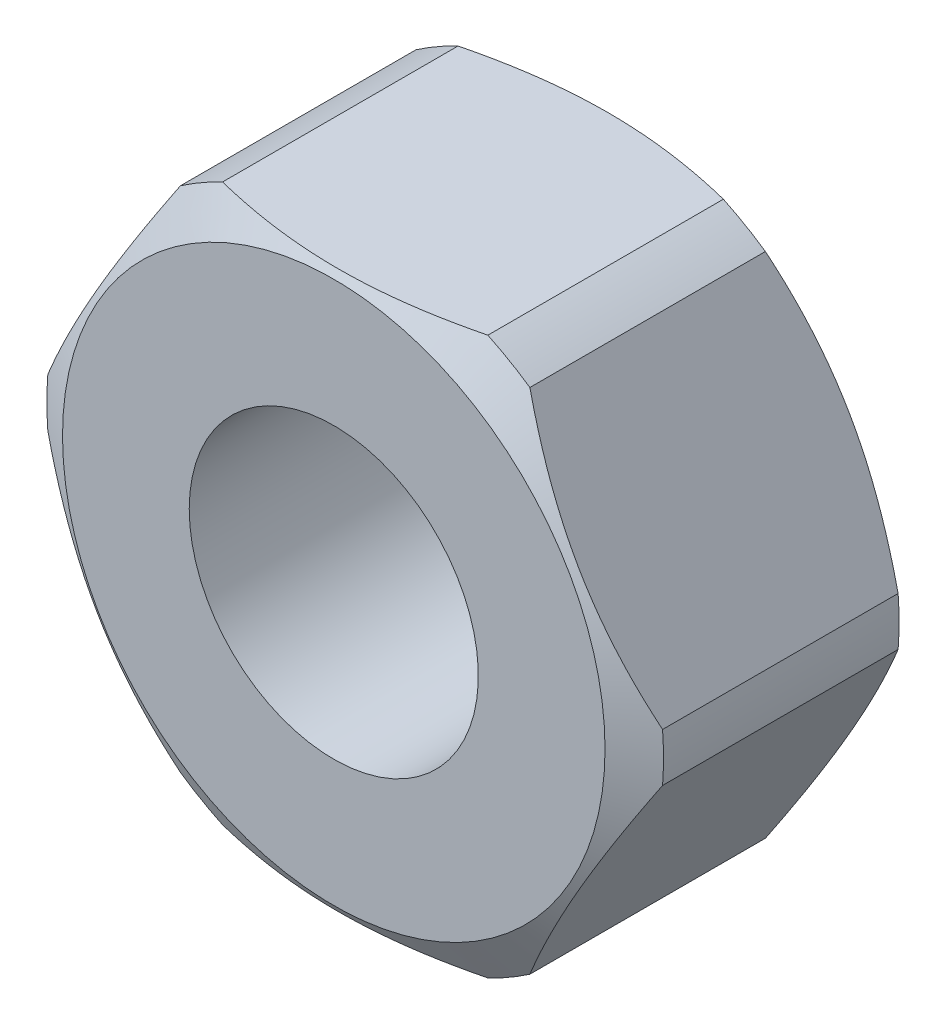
ISO-10303-21;
HEADER;
FILE_DESCRIPTION(('STEP AP214'),'2;1');
FILE_NAME('part.step','',(''),(''),'','','');
FILE_SCHEMA(('AUTOMOTIVE_DESIGN { 1 0 10303 214 1 1 1 1 }'));
ENDSEC;
DATA;
#1=APPLICATION_CONTEXT('core data for automotive mechanical design processes');
#2=APPLICATION_PROTOCOL_DEFINITION('international standard','automotive_design',2000,#1);
#3=PRODUCT_CONTEXT('',#1,'mechanical');
#4=PRODUCT('Part','Part','',(#3));
#5=PRODUCT_RELATED_PRODUCT_CATEGORY('part','',(#4));
#6=PRODUCT_DEFINITION_FORMATION('','',#4);
#7=PRODUCT_DEFINITION_CONTEXT('part definition',#1,'design');
#8=PRODUCT_DEFINITION('design','',#6,#7);
#9=PRODUCT_DEFINITION_SHAPE('','',#8);
#10=(LENGTH_UNIT() NAMED_UNIT(*) SI_UNIT(.MILLI.,.METRE.));
#11=(NAMED_UNIT(*) PLANE_ANGLE_UNIT() SI_UNIT($,.RADIAN.));
#12=(NAMED_UNIT(*) SI_UNIT($,.STERADIAN.) SOLID_ANGLE_UNIT());
#13=UNCERTAINTY_MEASURE_WITH_UNIT(LENGTH_MEASURE(1.E-05),#10,'distance_accuracy_value','');
#14=(GEOMETRIC_REPRESENTATION_CONTEXT(3) GLOBAL_UNCERTAINTY_ASSIGNED_CONTEXT((#13)) GLOBAL_UNIT_ASSIGNED_CONTEXT((#10,
#11,#12)) REPRESENTATION_CONTEXT('',''));
#15=CARTESIAN_POINT('',(0.,0.,0.));
#16=DIRECTION('',(0.,0.,1.));
#17=DIRECTION('',(1.,0.,0.));
#18=AXIS2_PLACEMENT_3D('',#15,#16,#17);
#19=CARTESIAN_POINT('',(0.,0.,6.5));
#20=DIRECTION('',(0.,0.,-1.));
#21=DIRECTION('',(-1.,0.,0.));
#22=AXIS2_PLACEMENT_3D('',#19,#20,#21);
#23=CYLINDRICAL_SURFACE('',#22,7.20062436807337);
#24=CARTESIAN_POINT('',(0.,0.,5.99999999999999));
#25=DIRECTION('',(0.,0.,1.));
#26=DIRECTION('',(1.,0.,0.));
#27=AXIS2_PLACEMENT_3D('',#24,#25,#26);
#28=CIRCLE('',#27,7.20062436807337);
#29=CARTESIAN_POINT('',(-7.17836265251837,-0.565774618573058,5.99999999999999));
#30=VERTEX_POINT('',#29);
#31=CARTESIAN_POINT('',(-7.17830561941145,0.566497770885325,5.99999999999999));
#32=VERTEX_POINT('',#31);
#33=EDGE_CURVE('E143',#30,#32,#28,.F.);
#34=ORIENTED_EDGE('',*,*,#33,.T.);
#35=DIRECTION('',(0.,0.,-1.));
#36=VECTOR('',#35,1.);
#37=CARTESIAN_POINT('',(-7.17830561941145,0.566497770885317,6.5));
#38=LINE('',#37,#36);
#39=CARTESIAN_POINT('',(-7.17830561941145,0.566497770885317,0.500000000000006));
#40=VERTEX_POINT('',#39);
#41=EDGE_CURVE('E51',#32,#40,#38,.T.);
#42=ORIENTED_EDGE('',*,*,#41,.T.);
#43=CARTESIAN_POINT('',(0.,0.,0.500000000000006));
#44=DIRECTION('',(0.,0.,1.));
#45=DIRECTION('',(1.,0.,0.));
#46=AXIS2_PLACEMENT_3D('',#43,#44,#45);
#47=CIRCLE('',#46,7.20062436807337);
#48=CARTESIAN_POINT('',(-7.17836265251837,-0.565774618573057,0.500000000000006));
#49=VERTEX_POINT('',#48);
#50=EDGE_CURVE('E291',#40,#49,#47,.T.);
#51=ORIENTED_EDGE('',*,*,#50,.T.);
#52=DIRECTION('',(0.,0.,-1.));
#53=VECTOR('',#52,1.);
#54=CARTESIAN_POINT('',(-7.17836265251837,-0.565774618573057,6.5));
#55=LINE('',#54,#53);
#56=EDGE_CURVE('E290',#49,#30,#55,.F.);
#57=ORIENTED_EDGE('',*,*,#56,.T.);
#58=EDGE_LOOP('',(#34,#42,#51,#57));
#59=FACE_BOUND('',#58,.T.);
#60=ADVANCED_FACE('F32',(#59),#23,.T.);
#61=CARTESIAN_POINT('',(-3.09953346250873,-6.49937563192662,6.00000000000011));
#62=VERTEX_POINT('',#61);
#63=CARTESIAN_POINT('',(-4.0791565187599,-5.93375710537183,5.99999999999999));
#64=VERTEX_POINT('',#63);
#65=EDGE_CURVE('E147',#62,#64,#28,.F.);
#66=ORIENTED_EDGE('',*,*,#65,.T.);
#67=DIRECTION('',(0.,0.,-1.));
#68=VECTOR('',#67,1.);
#69=CARTESIAN_POINT('',(-4.0791565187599,-5.93375710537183,6.5));
#70=LINE('',#69,#68);
#71=CARTESIAN_POINT('',(-4.0791565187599,-5.93375710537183,0.500000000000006));
#72=VERTEX_POINT('',#71);
#73=EDGE_CURVE('E59',#64,#72,#70,.T.);
#74=ORIENTED_EDGE('',*,*,#73,.T.);
#75=CARTESIAN_POINT('',(-3.09953346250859,-6.49937563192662,0.500000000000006));
#76=VERTEX_POINT('',#75);
#77=EDGE_CURVE('E299',#72,#76,#47,.T.);
#78=ORIENTED_EDGE('',*,*,#77,.T.);
#79=DIRECTION('',(0.,0.,-1.));
#80=VECTOR('',#79,1.);
#81=CARTESIAN_POINT('',(-3.09953346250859,-6.49937563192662,6.5));
#82=LINE('',#81,#80);
#83=EDGE_CURVE('E177',#76,#62,#82,.F.);
#84=ORIENTED_EDGE('',*,*,#83,.T.);
#85=EDGE_LOOP('',(#66,#74,#78,#84));
#86=FACE_BOUND('',#85,.T.);
#87=ADVANCED_FACE('F174',(#86),#23,.T.);
#88=CARTESIAN_POINT('',(4.07915651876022,-5.93375710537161,5.99999999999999));
#89=VERTEX_POINT('',#88);
#90=CARTESIAN_POINT('',(3.09953346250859,-6.49937563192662,5.99999999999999));
#91=VERTEX_POINT('',#90);
#92=EDGE_CURVE('E160',#89,#91,#28,.F.);
#93=ORIENTED_EDGE('',*,*,#92,.T.);
#94=DIRECTION('',(0.,0.,-1.));
#95=VECTOR('',#94,1.);
#96=CARTESIAN_POINT('',(3.09953346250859,-6.49937563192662,6.5));
#97=LINE('',#96,#95);
#98=CARTESIAN_POINT('',(3.09953346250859,-6.49937563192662,0.500000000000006));
#99=VERTEX_POINT('',#98);
#100=EDGE_CURVE('E255',#91,#99,#97,.T.);
#101=ORIENTED_EDGE('',*,*,#100,.T.);
#102=CARTESIAN_POINT('',(4.07915651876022,-5.93375710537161,0.500000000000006));
#103=VERTEX_POINT('',#102);
#104=EDGE_CURVE('E301',#99,#103,#47,.T.);
#105=ORIENTED_EDGE('',*,*,#104,.T.);
#106=DIRECTION('',(0.,0.,-1.));
#107=VECTOR('',#106,1.);
#108=CARTESIAN_POINT('',(4.07915651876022,-5.93375710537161,6.5));
#109=LINE('',#108,#107);
#110=EDGE_CURVE('E254',#103,#89,#109,.F.);
#111=ORIENTED_EDGE('',*,*,#110,.T.);
#112=EDGE_LOOP('',(#93,#101,#105,#111));
#113=FACE_BOUND('',#112,.T.);
#114=ADVANCED_FACE('F288',(#113),#23,.T.);
#115=CARTESIAN_POINT('',(7.17830561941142,0.566497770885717,5.99999999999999));
#116=VERTEX_POINT('',#115);
#117=CARTESIAN_POINT('',(7.17836265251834,-0.565774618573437,5.99999999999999));
#118=VERTEX_POINT('',#117);
#119=EDGE_CURVE('E154',#116,#118,#28,.F.);
#120=ORIENTED_EDGE('',*,*,#119,.T.);
#121=DIRECTION('',(0.,0.,-1.));
#122=VECTOR('',#121,1.);
#123=CARTESIAN_POINT('',(7.17836265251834,-0.565774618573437,6.5));
#124=LINE('',#123,#122);
#125=CARTESIAN_POINT('',(7.17836265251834,-0.565774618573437,0.500000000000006));
#126=VERTEX_POINT('',#125);
#127=EDGE_CURVE('E256',#118,#126,#124,.T.);
#128=ORIENTED_EDGE('',*,*,#127,.T.);
#129=CARTESIAN_POINT('',(7.17830561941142,0.566497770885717,0.500000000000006));
#130=VERTEX_POINT('',#129);
#131=EDGE_CURVE('E158',#126,#130,#47,.T.);
#132=ORIENTED_EDGE('',*,*,#131,.T.);
#133=DIRECTION('',(0.,0.,-1.));
#134=VECTOR('',#133,1.);
#135=CARTESIAN_POINT('',(7.17830561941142,0.566497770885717,6.5));
#136=LINE('',#135,#134);
#137=EDGE_CURVE('E258',#130,#116,#136,.F.);
#138=ORIENTED_EDGE('',*,*,#137,.T.);
#139=EDGE_LOOP('',(#120,#128,#132,#138));
#140=FACE_BOUND('',#139,.T.);
#141=ADVANCED_FACE('F335',(#140),#23,.T.);
#142=CARTESIAN_POINT('',(3.09822389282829,6.5,5.99999999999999));
#143=VERTEX_POINT('',#142);
#144=CARTESIAN_POINT('',(4.07975427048,5.93334613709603,5.99999999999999));
#145=VERTEX_POINT('',#144);
#146=EDGE_CURVE('E146',#143,#145,#28,.F.);
#147=ORIENTED_EDGE('',*,*,#146,.T.);
#148=DIRECTION('',(0.,0.,-1.));
#149=VECTOR('',#148,1.);
#150=CARTESIAN_POINT('',(4.07975427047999,5.93334613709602,6.5));
#151=LINE('',#150,#149);
#152=CARTESIAN_POINT('',(4.07975427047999,5.93334613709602,0.500000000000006));
#153=VERTEX_POINT('',#152);
#154=EDGE_CURVE('E262',#145,#153,#151,.T.);
#155=ORIENTED_EDGE('',*,*,#154,.T.);
#156=CARTESIAN_POINT('',(3.09822389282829,6.5,0.500000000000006));
#157=VERTEX_POINT('',#156);
#158=EDGE_CURVE('E153',#153,#157,#47,.T.);
#159=ORIENTED_EDGE('',*,*,#158,.T.);
#160=DIRECTION('',(0.,0.,-1.));
#161=VECTOR('',#160,1.);
#162=CARTESIAN_POINT('',(3.09822389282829,6.5,6.5));
#163=LINE('',#162,#161);
#164=EDGE_CURVE('E265',#157,#143,#163,.F.);
#165=ORIENTED_EDGE('',*,*,#164,.T.);
#166=EDGE_LOOP('',(#147,#155,#159,#165));
#167=FACE_BOUND('',#166,.T.);
#168=ADVANCED_FACE('F282',(#167),#23,.T.);
#169=CARTESIAN_POINT('',(0.,0.,6.5));
#170=DIRECTION('',(0.,0.,1.));
#171=DIRECTION('',(1.,0.,0.));
#172=AXIS2_PLACEMENT_3D('',#169,#170,#171);
#173=PLANE('',#172);
#174=CARTESIAN_POINT('',(0.,0.,6.5));
#175=DIRECTION('',(0.,0.,1.));
#176=DIRECTION('',(1.,0.,0.));
#177=AXIS2_PLACEMENT_3D('',#174,#175,#176);
#178=CIRCLE('',#177,6.33459896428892);
#179=CARTESIAN_POINT('',(6.33459896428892,0.,6.5));
#180=VERTEX_POINT('',#179);
#181=EDGE_CURVE('E305',#180,#180,#178,.T.);
#182=ORIENTED_EDGE('',*,*,#181,.T.);
#183=EDGE_LOOP('',(#182));
#184=FACE_BOUND('',#183,.T.);
#185=CARTESIAN_POINT('',(0.,0.,6.5));
#186=DIRECTION('',(0.,0.,1.));
#187=DIRECTION('',(1.,0.,0.));
#188=AXIS2_PLACEMENT_3D('',#185,#186,#187);
#189=CIRCLE('',#188,3.3756527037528);
#190=CARTESIAN_POINT('',(-3.3756527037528,0.,6.5));
#191=VERTEX_POINT('',#190);
#192=EDGE_CURVE('E144',#191,#191,#189,.T.);
#193=ORIENTED_EDGE('',*,*,#192,.F.);
#194=EDGE_LOOP('',(#193));
#195=FACE_BOUND('',#194,.T.);
#196=ADVANCED_FACE('F334',(#184,#195),#173,.T.);
#197=CARTESIAN_POINT('',(0.,0.,0.));
#198=DIRECTION('',(0.,0.,1.));
#199=DIRECTION('',(1.,0.,0.));
#200=AXIS2_PLACEMENT_3D('',#197,#198,#199);
#201=PLANE('',#200);
#202=CARTESIAN_POINT('',(0.,0.,0.));
#203=DIRECTION('',(0.,0.,1.));
#204=DIRECTION('',(1.,0.,0.));
#205=AXIS2_PLACEMENT_3D('',#202,#203,#204);
#206=CIRCLE('',#205,6.33459896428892);
#207=CARTESIAN_POINT('',(6.33459896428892,0.,0.));
#208=VERTEX_POINT('',#207);
#209=EDGE_CURVE('E300',#208,#208,#206,.F.);
#210=ORIENTED_EDGE('',*,*,#209,.T.);
#211=EDGE_LOOP('',(#210));
#212=FACE_BOUND('',#211,.T.);
#213=CARTESIAN_POINT('',(0.,0.,0.));
#214=DIRECTION('',(0.,0.,1.));
#215=DIRECTION('',(1.,0.,0.));
#216=AXIS2_PLACEMENT_3D('',#213,#214,#215);
#217=CIRCLE('',#216,3.3756527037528);
#218=CARTESIAN_POINT('',(-3.3756527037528,0.,0.));
#219=VERTEX_POINT('',#218);
#220=EDGE_CURVE('E149',#219,#219,#217,.T.);
#221=ORIENTED_EDGE('',*,*,#220,.T.);
#222=EDGE_LOOP('',(#221));
#223=FACE_BOUND('',#222,.T.);
#224=ADVANCED_FACE('F275',(#212,#223),#201,.F.);
#225=CARTESIAN_POINT('',(-3.09822389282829,6.5,0.500000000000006));
#226=VERTEX_POINT('',#225);
#227=CARTESIAN_POINT('',(-4.07975427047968,5.93334613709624,0.500000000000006));
#228=VERTEX_POINT('',#227);
#229=EDGE_CURVE('E136',#226,#228,#47,.T.);
#230=ORIENTED_EDGE('',*,*,#229,.T.);
#231=DIRECTION('',(0.,0.,-1.));
#232=VECTOR('',#231,1.);
#233=CARTESIAN_POINT('',(-4.07975427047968,5.93334613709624,6.5));
#234=LINE('',#233,#232);
#235=CARTESIAN_POINT('',(-4.07975427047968,5.93334613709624,5.99999999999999));
#236=VERTEX_POINT('',#235);
#237=EDGE_CURVE('E124',#228,#236,#234,.F.);
#238=ORIENTED_EDGE('',*,*,#237,.T.);
#239=CARTESIAN_POINT('',(-3.09822389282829,6.5,5.99999999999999));
#240=VERTEX_POINT('',#239);
#241=EDGE_CURVE('E133',#236,#240,#28,.F.);
#242=ORIENTED_EDGE('',*,*,#241,.T.);
#243=DIRECTION('',(0.,0.,-1.));
#244=VECTOR('',#243,1.);
#245=CARTESIAN_POINT('',(-3.09822389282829,6.5,6.5));
#246=LINE('',#245,#244);
#247=EDGE_CURVE('E268',#240,#226,#246,.T.);
#248=ORIENTED_EDGE('',*,*,#247,.T.);
#249=EDGE_LOOP('',(#230,#238,#242,#248));
#250=FACE_BOUND('',#249,.T.);
#251=ADVANCED_FACE('F34',(#250),#23,.T.);
#252=CARTESIAN_POINT('',(0.,0.,6.5));
#253=DIRECTION('',(0.,0.,-1.));
#254=DIRECTION('',(-1.,0.,0.));
#255=AXIS2_PLACEMENT_3D('',#252,#253,#254);
#256=CYLINDRICAL_SURFACE('',#255,3.3756527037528);
#257=CARTESIAN_POINT('',(-3.3756527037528,0.,6.5));
#258=CARTESIAN_POINT('',(-3.3756527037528,0.,6.43229166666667));
#259=CARTESIAN_POINT('',(-3.3756527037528,0.,6.36458333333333));
#260=CARTESIAN_POINT('',(-3.3756527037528,0.,6.22916666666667));
#261=CARTESIAN_POINT('',(-3.3756527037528,0.,6.16145833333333));
#262=CARTESIAN_POINT('',(-3.3756527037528,0.,6.02604166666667));
#263=CARTESIAN_POINT('',(-3.3756527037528,0.,5.95833333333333));
#264=CARTESIAN_POINT('',(-3.3756527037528,0.,5.82291666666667));
#265=CARTESIAN_POINT('',(-3.3756527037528,0.,5.75520833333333));
#266=CARTESIAN_POINT('',(-3.3756527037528,0.,5.61979166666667));
#267=CARTESIAN_POINT('',(-3.3756527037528,0.,5.55208333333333));
#268=CARTESIAN_POINT('',(-3.3756527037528,0.,5.41666666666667));
#269=CARTESIAN_POINT('',(-3.3756527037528,0.,5.34895833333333));
#270=CARTESIAN_POINT('',(-3.3756527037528,0.,5.21354166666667));
#271=CARTESIAN_POINT('',(-3.3756527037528,0.,5.14583333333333));
#272=CARTESIAN_POINT('',(-3.3756527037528,0.,5.01041666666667));
#273=CARTESIAN_POINT('',(-3.3756527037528,0.,4.94270833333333));
#274=CARTESIAN_POINT('',(-3.3756527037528,0.,4.80729166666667));
#275=CARTESIAN_POINT('',(-3.3756527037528,0.,4.73958333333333));
#276=CARTESIAN_POINT('',(-3.3756527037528,0.,4.60416666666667));
#277=CARTESIAN_POINT('',(-3.3756527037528,0.,4.53645833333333));
#278=CARTESIAN_POINT('',(-3.3756527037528,0.,4.40104166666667));
#279=CARTESIAN_POINT('',(-3.3756527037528,0.,4.33333333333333));
#280=CARTESIAN_POINT('',(-3.3756527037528,0.,4.19791666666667));
#281=CARTESIAN_POINT('',(-3.3756527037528,0.,4.13020833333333));
#282=CARTESIAN_POINT('',(-3.3756527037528,0.,3.99479166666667));
#283=CARTESIAN_POINT('',(-3.3756527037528,0.,3.92708333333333));
#284=CARTESIAN_POINT('',(-3.3756527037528,0.,3.79166666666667));
#285=CARTESIAN_POINT('',(-3.3756527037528,0.,3.72395833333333));
#286=CARTESIAN_POINT('',(-3.3756527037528,0.,3.58854166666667));
#287=CARTESIAN_POINT('',(-3.3756527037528,0.,3.52083333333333));
#288=CARTESIAN_POINT('',(-3.3756527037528,0.,3.38541666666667));
#289=CARTESIAN_POINT('',(-3.3756527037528,0.,3.31770833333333));
#290=CARTESIAN_POINT('',(-3.3756527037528,0.,3.18229166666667));
#291=CARTESIAN_POINT('',(-3.3756527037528,0.,3.11458333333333));
#292=CARTESIAN_POINT('',(-3.3756527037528,0.,2.97916666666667));
#293=CARTESIAN_POINT('',(-3.3756527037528,0.,2.91145833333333));
#294=CARTESIAN_POINT('',(-3.3756527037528,0.,2.77604166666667));
#295=CARTESIAN_POINT('',(-3.3756527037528,0.,2.70833333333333));
#296=CARTESIAN_POINT('',(-3.3756527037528,0.,2.57291666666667));
#297=CARTESIAN_POINT('',(-3.3756527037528,0.,2.50520833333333));
#298=CARTESIAN_POINT('',(-3.3756527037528,0.,2.36979166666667));
#299=CARTESIAN_POINT('',(-3.3756527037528,0.,2.30208333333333));
#300=CARTESIAN_POINT('',(-3.3756527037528,0.,2.16666666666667));
#301=CARTESIAN_POINT('',(-3.3756527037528,0.,2.09895833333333));
#302=CARTESIAN_POINT('',(-3.3756527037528,0.,1.96354166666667));
#303=CARTESIAN_POINT('',(-3.3756527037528,0.,1.89583333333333));
#304=CARTESIAN_POINT('',(-3.3756527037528,0.,1.76041666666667));
#305=CARTESIAN_POINT('',(-3.3756527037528,0.,1.69270833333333));
#306=CARTESIAN_POINT('',(-3.3756527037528,0.,1.55729166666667));
#307=CARTESIAN_POINT('',(-3.3756527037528,0.,1.48958333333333));
#308=CARTESIAN_POINT('',(-3.3756527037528,0.,1.35416666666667));
#309=CARTESIAN_POINT('',(-3.3756527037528,0.,1.28645833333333));
#310=CARTESIAN_POINT('',(-3.3756527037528,0.,1.15104166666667));
#311=CARTESIAN_POINT('',(-3.3756527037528,0.,1.08333333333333));
#312=CARTESIAN_POINT('',(-3.3756527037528,0.,0.947916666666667));
#313=CARTESIAN_POINT('',(-3.3756527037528,0.,0.880208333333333));
#314=CARTESIAN_POINT('',(-3.3756527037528,0.,0.744791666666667));
#315=CARTESIAN_POINT('',(-3.3756527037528,0.,0.677083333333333));
#316=CARTESIAN_POINT('',(-3.3756527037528,0.,0.541666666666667));
#317=CARTESIAN_POINT('',(-3.3756527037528,0.,0.473958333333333));
#318=CARTESIAN_POINT('',(-3.3756527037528,0.,0.338541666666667));
#319=CARTESIAN_POINT('',(-3.3756527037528,0.,0.270833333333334));
#320=CARTESIAN_POINT('',(-3.3756527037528,0.,0.135416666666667));
#321=CARTESIAN_POINT('',(-3.3756527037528,0.,0.0677083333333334));
#322=CARTESIAN_POINT('',(-3.3756527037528,0.,0.));
#323=B_SPLINE_CURVE_WITH_KNOTS('',3,(#257,#258,#259,#260,#261,#262,#263,#264,#265,#266,#267,
#268,#269,#270,#271,#272,#273,#274,#275,#276,#277,#278,#279,#280,#281,#282,#283,#284,#285,#286,
#287,#288,#289,#290,#291,#292,#293,#294,#295,#296,#297,#298,#299,#300,#301,#302,#303,#304,#305,
#306,#307,#308,#309,#310,#311,#312,#313,#314,#315,#316,#317,#318,#319,#320,#321,#322),
.UNSPECIFIED.,.F.,.F.,(4,2,2,2,2,2,2,2,2,2,2,2,2,2,2,2,2,2,2,2,2,2,2,2,2,2,2,2,2,2,2,2,4),(0.,
0.203125,0.40625,0.609375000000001,0.812500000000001,1.015625,1.21875,1.421875,1.625,1.828125,
2.03125,2.234375,2.4375,2.640625,2.84375,3.046875,3.25,3.453125,3.65625,3.859375,4.0625,
4.265625,4.46875,4.671875,4.875,5.078125,5.28125,5.484375,5.6875,5.890625,6.09375,6.296875,6.5),.UNSPECIFIED.);
#324=EDGE_CURVE('BSEAM217',#191,#219,#323,.T.);
#325=ORIENTED_EDGE('',*,*,#192,.T.);
#326=ORIENTED_EDGE('',*,*,#220,.F.);
#327=ORIENTED_EDGE('',*,*,#324,.T.);
#328=ORIENTED_EDGE('',*,*,#324,.F.);
#329=EDGE_LOOP('',(#325,#327,#326,#328));
#330=FACE_BOUND('',#329,.T.);
#331=ADVANCED_FACE('F217',(#330),#256,.F.);
#332=CARTESIAN_POINT('',(0.,0.,0.500000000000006));
#333=DIRECTION('',(0.,0.,1.));
#334=DIRECTION('',(1.,0.,0.));
#335=AXIS2_PLACEMENT_3D('',#332,#333,#334);
#336=CONICAL_SURFACE('',#335,7.20062436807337,1.0471975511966);
#337=CARTESIAN_POINT('',(-4.07935180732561,5.93404322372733,0.500200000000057));
#338=CARTESIAN_POINT('',(-4.15928234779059,5.7955994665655,0.460472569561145));
#339=CARTESIAN_POINT('',(-4.23951550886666,5.65663155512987,0.423103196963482));
#340=CARTESIAN_POINT('',(-4.40057318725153,5.37767147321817,0.353623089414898));
#341=CARTESIAN_POINT('',(-4.48139787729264,5.23767900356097,0.321513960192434));
#342=CARTESIAN_POINT('',(-4.64368270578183,4.9565934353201,0.263083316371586));
#343=CARTESIAN_POINT('',(-4.72514354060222,4.81549913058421,0.236769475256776));
#344=CARTESIAN_POINT('',(-4.88851000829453,4.53254010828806,0.190503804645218));
#345=CARTESIAN_POINT('',(-4.97041559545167,4.39067546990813,0.170551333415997));
#346=CARTESIAN_POINT('',(-5.13290422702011,4.10923690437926,0.137778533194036));
#347=CARTESIAN_POINT('',(-5.21348033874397,3.96967498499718,0.124821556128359));
#348=CARTESIAN_POINT('',(-5.37483384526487,3.69020251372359,0.105725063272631));
#349=CARTESIAN_POINT('',(-5.45561123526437,3.55029197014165,0.09958538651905));
#350=CARTESIAN_POINT('',(-5.61715999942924,3.27048130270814,0.0942719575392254));
#351=CARTESIAN_POINT('',(-5.69793132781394,3.130581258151,0.0950926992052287));
#352=CARTESIAN_POINT('',(-5.8593751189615,2.8509524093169,0.103665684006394));
#353=CARTESIAN_POINT('',(-5.94004758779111,2.711223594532,0.111417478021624));
#354=CARTESIAN_POINT('',(-6.11766613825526,2.40357924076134,0.135953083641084));
#355=CARTESIAN_POINT('',(-6.21455997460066,2.23575419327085,0.154262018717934));
#356=CARTESIAN_POINT('',(-6.40781261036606,1.90103080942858,0.2000991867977));
#357=CARTESIAN_POINT('',(-6.50417130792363,1.73413264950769,0.227629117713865));
#358=CARTESIAN_POINT('',(-6.69740145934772,1.39944820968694,0.291512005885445));
#359=CARTESIAN_POINT('',(-6.79426393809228,1.23167747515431,0.327972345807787));
#360=CARTESIAN_POINT('',(-6.98713320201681,0.897618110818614,0.408566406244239));
#361=CARTESIAN_POINT('',(-7.08314044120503,0.731328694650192,0.452695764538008));
#362=CARTESIAN_POINT('',(-7.17870808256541,0.565800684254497,0.500200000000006));
#363=B_SPLINE_CURVE_WITH_KNOTS('',3,(#337,#338,#339,#340,#341,#342,#343,#344,#345,#346,#347,
#348,#349,#350,#351,#352,#353,#354,#355,#356,#357,#358,#359,#360,#361,#362),.UNSPECIFIED.,.F.,
.F.,(4,2,2,2,2,2,2,2,2,2,2,2,4),(0.,0.494180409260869,0.988511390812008,1.48349302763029,
1.9784247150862,2.46330241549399,2.94816866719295,3.43265139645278,3.91710273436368,
4.5008110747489,5.08462695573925,5.67584080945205,6.26671946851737),.UNSPECIFIED.);
#364=EDGE_CURVE('E293',#228,#40,#363,.T.);
#365=ORIENTED_EDGE('',*,*,#364,.F.);
#366=ORIENTED_EDGE('',*,*,#229,.F.);
#367=CARTESIAN_POINT('',(-9.29123509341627,6.5,2.88939739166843));
#368=CARTESIAN_POINT('',(-9.01831173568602,6.5,2.76032407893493));
#369=CARTESIAN_POINT('',(-8.74468441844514,6.5,2.63270965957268));
#370=CARTESIAN_POINT('',(-8.19565467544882,6.5,2.3812167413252));
#371=CARTESIAN_POINT('',(-7.92025190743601,6.5,2.25733899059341));
#372=CARTESIAN_POINT('',(-7.36572617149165,6.5,2.01344792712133));
#373=CARTESIAN_POINT('',(-7.08659075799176,6.5,1.89346279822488));
#374=CARTESIAN_POINT('',(-6.52588428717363,6.5,1.65934673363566));
#375=CARTESIAN_POINT('',(-6.24431336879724,6.5,1.54521546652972));
#376=CARTESIAN_POINT('',(-5.67697947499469,6.5,1.32382125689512));
#377=CARTESIAN_POINT('',(-5.39120320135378,6.5,1.21659218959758));
#378=CARTESIAN_POINT('',(-4.81622306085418,6.5,1.01158106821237));
#379=CARTESIAN_POINT('',(-4.5270188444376,6.5,0.913799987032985));
#380=CARTESIAN_POINT('',(-3.94544521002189,6.5,0.730478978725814));
#381=CARTESIAN_POINT('',(-3.6530846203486,6.5,0.644911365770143));
#382=CARTESIAN_POINT('',(-3.0644092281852,6.5,0.48889097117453));
#383=CARTESIAN_POINT('',(-2.76809567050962,6.5,0.418433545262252));
#384=CARTESIAN_POINT('',(-2.16006092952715,6.5,0.293761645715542));
#385=CARTESIAN_POINT('',(-1.84818555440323,6.5,0.24027634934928));
#386=CARTESIAN_POINT('',(-1.37801604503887,6.5,0.177887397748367));
#387=CARTESIAN_POINT('',(-1.22087891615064,6.5,0.160063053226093));
#388=CARTESIAN_POINT('',(-0.906022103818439,6.5,0.130714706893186));
#389=CARTESIAN_POINT('',(-0.748302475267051,6.5,0.119190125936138));
#390=CARTESIAN_POINT('',(-0.433193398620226,6.5,0.102732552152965));
#391=CARTESIAN_POINT('',(-0.275805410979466,6.5,0.0977716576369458));
#392=CARTESIAN_POINT('',(0.0390386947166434,6.5,0.0944617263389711));
#393=CARTESIAN_POINT('',(0.196494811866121,6.5,0.0961126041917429));
#394=CARTESIAN_POINT('',(0.511164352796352,6.5,0.105988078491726));
#395=CARTESIAN_POINT('',(0.668377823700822,6.5,0.114211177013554));
#396=CARTESIAN_POINT('',(0.982343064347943,6.5,0.137043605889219));
#397=CARTESIAN_POINT('',(1.13909480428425,6.5,0.151653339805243));
#398=CARTESIAN_POINT('',(1.53340654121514,6.5,0.196155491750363));
#399=CARTESIAN_POINT('',(1.77052286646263,6.5,0.230044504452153));
#400=CARTESIAN_POINT('',(2.24260027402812,6.5,0.310434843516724));
#401=CARTESIAN_POINT('',(2.47756095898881,6.5,0.356938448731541));
#402=CARTESIAN_POINT('',(3.17977604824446,6.5,0.512999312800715));
#403=CARTESIAN_POINT('',(3.64340602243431,6.5,0.638985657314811));
#404=CARTESIAN_POINT('',(4.33587705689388,6.5,0.852367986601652));
#405=CARTESIAN_POINT('',(4.5684177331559,6.5,0.928412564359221));
#406=CARTESIAN_POINT('',(5.03126115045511,6.5,1.08715005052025));
#407=CARTESIAN_POINT('',(5.26156370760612,6.5,1.16984350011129));
#408=CARTESIAN_POINT('',(5.71876890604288,6.5,1.340181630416));
#409=CARTESIAN_POINT('',(5.94568357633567,6.5,1.42779433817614));
#410=CARTESIAN_POINT('',(6.39765675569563,6.5,1.60748865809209));
#411=CARTESIAN_POINT('',(6.62271582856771,6.5,1.69956884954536));
#412=CARTESIAN_POINT('',(6.84700444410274,6.5,1.79345055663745));
#413=B_SPLINE_CURVE_WITH_KNOTS('',3,(#367,#368,#369,#370,#371,#372,#373,#374,#375,#376,#377,
#378,#379,#380,#381,#382,#383,#384,#385,#386,#387,#388,#389,#390,#391,#392,#393,#394,#395,#396,
#397,#398,#399,#400,#401,#402,#403,#404,#405,#406,#407,#408,#409,#410,#411,#412),.UNSPECIFIED.,
.F.,.F.,(4,2,2,2,2,2,2,2,2,2,2,2,2,2,2,2,2,2,2,2,2,2,4),(0.,0.905731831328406,1.81164381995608,
2.72308208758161,3.63446869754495,4.55003224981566,5.46568998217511,6.37923794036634,
7.29250470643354,8.24090644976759,8.71523448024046,9.18951889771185,9.6617806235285,
10.1340362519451,10.6061842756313,11.0783621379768,11.7965213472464,12.5148103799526,
13.9542711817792,14.6882035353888,15.4221956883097,16.1518718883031,16.881317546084),.UNSPECIFIED.);
#414=EDGE_CURVE('E223',#157,#226,#413,.F.);
#415=ORIENTED_EDGE('',*,*,#414,.F.);
#416=ORIENTED_EDGE('',*,*,#158,.F.);
#417=CARTESIAN_POINT('',(7.17870808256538,0.565800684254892,0.500200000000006));
#418=CARTESIAN_POINT('',(7.09877754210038,0.704244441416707,0.46047256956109));
#419=CARTESIAN_POINT('',(7.0185443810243,0.843212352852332,0.42310319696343));
#420=CARTESIAN_POINT('',(6.85748670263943,1.12217243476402,0.353623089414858));
#421=CARTESIAN_POINT('',(6.77666201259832,1.26216490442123,0.321513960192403));
#422=CARTESIAN_POINT('',(6.61437718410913,1.5432504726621,0.263083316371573));
#423=CARTESIAN_POINT('',(6.53291634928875,1.68434477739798,0.236769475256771));
#424=CARTESIAN_POINT('',(6.36954988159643,1.96730379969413,0.190503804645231));
#425=CARTESIAN_POINT('',(6.28764429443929,2.10916843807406,0.170551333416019));
#426=CARTESIAN_POINT('',(6.12515566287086,2.39060700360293,0.137778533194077));
#427=CARTESIAN_POINT('',(6.04457955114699,2.53016892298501,0.124821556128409));
#428=CARTESIAN_POINT('',(5.88322604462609,2.8096413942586,0.105725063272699));
#429=CARTESIAN_POINT('',(5.80244865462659,2.94955193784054,0.0995853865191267));
#430=CARTESIAN_POINT('',(5.64089989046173,3.22936260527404,0.09427195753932));
#431=CARTESIAN_POINT('',(5.56012856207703,3.36926264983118,0.0950926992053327));
#432=CARTESIAN_POINT('',(5.39868477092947,3.64889149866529,0.103665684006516));
#433=CARTESIAN_POINT('',(5.31801230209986,3.78862031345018,0.111417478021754));
#434=CARTESIAN_POINT('',(5.14039375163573,4.09626466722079,0.135953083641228));
#435=CARTESIAN_POINT('',(5.04349991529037,4.26408971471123,0.15426201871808));
#436=CARTESIAN_POINT('',(4.85024727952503,4.59881309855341,0.200099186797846));
#437=CARTESIAN_POINT('',(4.75388858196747,4.76571125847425,0.227629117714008));
#438=CARTESIAN_POINT('',(4.56065843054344,5.1003956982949,0.291512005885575));
#439=CARTESIAN_POINT('',(4.46379595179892,5.26816643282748,0.327972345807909));
#440=CARTESIAN_POINT('',(4.27092668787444,5.60222579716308,0.408566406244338));
#441=CARTESIAN_POINT('',(4.17491944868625,5.76851521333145,0.452695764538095));
#442=CARTESIAN_POINT('',(4.0793518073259,5.9340432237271,0.500200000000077));
#443=B_SPLINE_CURVE_WITH_KNOTS('',3,(#417,#418,#419,#420,#421,#422,#423,#424,#425,#426,#427,
#428,#429,#430,#431,#432,#433,#434,#435,#436,#437,#438,#439,#440,#441,#442),.UNSPECIFIED.,.F.,
.F.,(4,2,2,2,2,2,2,2,2,2,2,2,4),(0.,0.494180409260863,0.988511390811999,1.48349302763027,
1.97842471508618,2.46330241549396,2.94816866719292,3.43265139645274,3.91710273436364,
4.5008110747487,5.08462695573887,5.67584080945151,6.26671946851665),.UNSPECIFIED.);
#444=EDGE_CURVE('E233',#130,#153,#443,.T.);
#445=ORIENTED_EDGE('',*,*,#444,.F.);
#446=ORIENTED_EDGE('',*,*,#131,.F.);
#447=CARTESIAN_POINT('',(4.07875414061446,-5.93445404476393,0.500200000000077));
#448=CARTESIAN_POINT('',(4.15868373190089,-5.79601193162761,0.460464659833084));
#449=CARTESIAN_POINT('',(4.23891596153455,-5.65704563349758,0.423087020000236));
#450=CARTESIAN_POINT('',(4.39997185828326,-5.37808863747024,0.353589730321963));
#451=CARTESIAN_POINT('',(4.48079569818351,-5.2380976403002,0.321471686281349));
#452=CARTESIAN_POINT('',(4.64307904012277,-4.95701464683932,0.263022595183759));
#453=CARTESIAN_POINT('',(4.72453923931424,-4.81592144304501,0.236699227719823));
#454=CARTESIAN_POINT('',(4.88790459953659,-4.53296433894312,0.190414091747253));
#455=CARTESIAN_POINT('',(4.96980971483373,-4.39110051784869,0.170451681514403));
#456=CARTESIAN_POINT('',(5.13229716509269,-4.10966399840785,0.137659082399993));
#457=CARTESIAN_POINT('',(5.21287256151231,-3.97010331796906,0.124692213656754));
#458=CARTESIAN_POINT('',(5.37422484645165,-3.69063296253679,0.105575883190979));
#459=CARTESIAN_POINT('',(5.45500173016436,-3.55072329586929,0.0994262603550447));
#460=CARTESIAN_POINT('',(5.61654966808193,-3.27091405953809,0.0940931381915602));
#461=CARTESIAN_POINT('',(5.69732067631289,-3.1310145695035,0.0949041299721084));
#462=CARTESIAN_POINT('',(5.85876402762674,-2.85138648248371,0.103458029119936));
#463=CARTESIAN_POINT('',(5.93943637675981,-2.7116578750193,0.111200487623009));
#464=CARTESIAN_POINT('',(6.11711094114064,-2.40391650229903,0.135723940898));
#465=CARTESIAN_POINT('',(6.21406075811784,-2.23599449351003,0.154035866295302));
#466=CARTESIAN_POINT('',(6.40742484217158,-1.90107807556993,0.19989041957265));
#467=CARTESIAN_POINT('',(6.503839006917,-1.73408384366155,0.227434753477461));
#468=CARTESIAN_POINT('',(6.69718095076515,-1.39920577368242,0.291357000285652));
#469=CARTESIAN_POINT('',(6.79409973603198,-1.2313375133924,0.327842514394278));
#470=CARTESIAN_POINT('',(6.98708044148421,-0.897085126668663,0.408495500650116));
#471=CARTESIAN_POINT('',(7.08314281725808,-0.730700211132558,0.452658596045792));
#472=CARTESIAN_POINT('',(7.17876503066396,-0.565077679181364,0.500200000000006));
#473=B_SPLINE_CURVE_WITH_KNOTS('',3,(#447,#448,#449,#450,#451,#452,#453,#454,#455,#456,#457,
#458,#459,#460,#461,#462,#463,#464,#465,#466,#467,#468,#469,#470,#471,#472),.UNSPECIFIED.,.F.,
.F.,(4,2,2,2,2,2,2,2,2,2,2,2,4),(0.,0.494180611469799,0.988511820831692,1.48349426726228,
1.97842676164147,2.46330256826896,2.94816691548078,3.43264755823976,3.91709682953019,
4.50113991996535,5.08529099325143,5.67685054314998,6.2680739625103),.UNSPECIFIED.);
#474=EDGE_CURVE('E242',#103,#126,#473,.T.);
#475=ORIENTED_EDGE('',*,*,#474,.F.);
#476=ORIENTED_EDGE('',*,*,#104,.F.);
#477=CARTESIAN_POINT('',(-9.29112737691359,-6.49937563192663,2.88913979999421));
#478=CARTESIAN_POINT('',(-9.01821168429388,-6.49937563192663,2.76006652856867));
#479=CARTESIAN_POINT('',(-8.74459211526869,-6.49937563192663,2.63245194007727));
#480=CARTESIAN_POINT('',(-8.19557805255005,-6.49937563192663,2.38095818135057));
#481=CARTESIAN_POINT('',(-7.92018321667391,-6.49937563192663,2.2570797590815));
#482=CARTESIAN_POINT('',(-7.36567356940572,-6.49937563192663,2.01318675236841));
#483=CARTESIAN_POINT('',(-7.08654631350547,-6.49937563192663,1.89320034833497));
#484=CARTESIAN_POINT('',(-6.52585634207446,-6.49937563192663,1.65908103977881));
#485=CARTESIAN_POINT('',(-6.24429376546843,-6.49937563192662,1.54494780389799));
#486=CARTESIAN_POINT('',(-5.67697466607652,-6.49937563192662,1.32354804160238));
#487=CARTESIAN_POINT('',(-5.39120482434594,-6.49937563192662,1.21631544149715));
#488=CARTESIAN_POINT('',(-4.81623759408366,-6.49937563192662,1.01129653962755));
#489=CARTESIAN_POINT('',(-4.52703985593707,-6.49937563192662,0.91351121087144));
#490=CARTESIAN_POINT('',(-3.94547910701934,-6.49937563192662,0.730181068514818));
#491=CARTESIAN_POINT('',(-3.65312492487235,-6.49937563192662,0.644608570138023));
#492=CARTESIAN_POINT('',(-3.06446211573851,-6.49937563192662,0.488577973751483));
#493=CARTESIAN_POINT('',(-2.76815473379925,-6.49937563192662,0.418115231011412));
#494=CARTESIAN_POINT('',(-2.1601520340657,-6.49937563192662,0.29343656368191));
#495=CARTESIAN_POINT('',(-1.84830278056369,-6.49937563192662,0.239948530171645));
#496=CARTESIAN_POINT('',(-1.3781722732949,-6.49937563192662,0.177553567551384));
#497=CARTESIAN_POINT('',(-1.22104811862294,-6.49937563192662,0.159726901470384));
#498=CARTESIAN_POINT('',(-0.90621715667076,-6.49937563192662,0.13037332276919));
#499=CARTESIAN_POINT('',(-0.748510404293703,-6.49937563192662,0.118845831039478));
#500=CARTESIAN_POINT('',(-0.433427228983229,-6.49937563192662,0.102381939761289));
#501=CARTESIAN_POINT('',(-0.276052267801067,-6.49937563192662,0.0974176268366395));
#502=CARTESIAN_POINT('',(0.0387659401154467,-6.49937563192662,0.0941003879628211));
#503=CARTESIAN_POINT('',(0.196209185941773,-6.49937563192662,0.0957473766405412));
#504=CARTESIAN_POINT('',(0.510853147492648,-6.49937563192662,0.105614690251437));
#505=CARTESIAN_POINT('',(0.66805391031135,-6.49937563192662,0.113833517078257));
#506=CARTESIAN_POINT('',(0.981993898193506,-6.49937563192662,0.136657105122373));
#507=CARTESIAN_POINT('',(1.13873309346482,-6.49937563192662,0.151262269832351));
#508=CARTESIAN_POINT('',(1.5329991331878,-6.49937563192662,0.195751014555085));
#509=CARTESIAN_POINT('',(1.77008249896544,-6.49937563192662,0.229630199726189));
#510=CARTESIAN_POINT('',(2.24209455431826,-6.49937563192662,0.309999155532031));
#511=CARTESIAN_POINT('',(2.47702284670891,-6.49937563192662,0.356491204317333));
#512=CARTESIAN_POINT('',(3.17914137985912,-6.49937563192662,0.512515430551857));
#513=CARTESIAN_POINT('',(3.64270798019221,-6.49937563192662,0.638474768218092));
#514=CARTESIAN_POINT('',(4.33508546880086,-6.49937563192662,0.851814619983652));
#515=CARTESIAN_POINT('',(4.56759541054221,-6.49937563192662,0.927844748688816));
#516=CARTESIAN_POINT('',(5.03037763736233,-6.49937563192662,1.08655286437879));
#517=CARTESIAN_POINT('',(5.2606497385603,-6.49937563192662,1.16923139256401));
#518=CARTESIAN_POINT('',(5.71779446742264,-6.49937563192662,1.33953944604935));
#519=CARTESIAN_POINT('',(5.94467912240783,-6.49937563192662,1.4271370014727));
#520=CARTESIAN_POINT('',(6.3965924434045,-6.49937563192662,1.6068007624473));
#521=CARTESIAN_POINT('',(6.62162167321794,-6.49937563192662,1.69886554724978));
#522=CARTESIAN_POINT('',(6.84588050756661,-6.49937563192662,1.79273175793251));
#523=B_SPLINE_CURVE_WITH_KNOTS('',3,(#477,#478,#479,#480,#481,#482,#483,#484,#485,#486,#487,
#488,#489,#490,#491,#492,#493,#494,#495,#496,#497,#498,#499,#500,#501,#502,#503,#504,#505,#506,
#507,#508,#509,#510,#511,#512,#513,#514,#515,#516,#517,#518,#519,#520,#521,#522),.UNSPECIFIED.,
.F.,.F.,(4,2,2,2,2,2,2,2,2,2,2,2,2,2,2,2,2,2,2,2,2,2,4),(0.,0.905710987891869,1.81160210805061,
2.72301941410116,3.63438506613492,4.5499342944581,5.46557771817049,6.37911136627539,
7.29236379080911,8.24068981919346,8.71497997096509,9.18922651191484,9.66144951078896,
10.133666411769,10.6057756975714,11.0779148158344,11.7959720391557,12.5141590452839,
13.953415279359,14.6872465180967,15.4211375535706,16.1507133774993,16.8800586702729),.UNSPECIFIED.);
#524=EDGE_CURVE('E249',#76,#99,#523,.T.);
#525=ORIENTED_EDGE('',*,*,#524,.F.);
#526=ORIENTED_EDGE('',*,*,#77,.F.);
#527=CARTESIAN_POINT('',(-7.17876503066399,-0.565077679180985,0.500200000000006));
#528=CARTESIAN_POINT('',(-7.09883543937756,-0.703519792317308,0.460464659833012));
#529=CARTESIAN_POINT('',(-7.0186032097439,-0.84248609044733,0.423087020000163));
#530=CARTESIAN_POINT('',(-6.85754731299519,-1.12144308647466,0.353589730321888));
#531=CARTESIAN_POINT('',(-6.77672347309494,-1.2614340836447,0.321471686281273));
#532=CARTESIAN_POINT('',(-6.61444013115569,-1.54251707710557,0.263022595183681));
#533=CARTESIAN_POINT('',(-6.53297993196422,-1.68361028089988,0.236699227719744));
#534=CARTESIAN_POINT('',(-6.36961457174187,-1.96656738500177,0.190414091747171));
#535=CARTESIAN_POINT('',(-6.28770945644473,-2.1084312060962,0.17045168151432));
#536=CARTESIAN_POINT('',(-6.12522200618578,-2.38986772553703,0.137659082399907));
#537=CARTESIAN_POINT('',(-6.04464660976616,-2.52942840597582,0.124692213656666));
#538=CARTESIAN_POINT('',(-5.88329432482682,-2.80889876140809,0.105575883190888));
#539=CARTESIAN_POINT('',(-5.80251744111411,-2.94880842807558,0.0994262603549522));
#540=CARTESIAN_POINT('',(-5.64096950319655,-3.22861766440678,0.0940931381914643));
#541=CARTESIAN_POINT('',(-5.56019849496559,-3.36851715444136,0.0949041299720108));
#542=CARTESIAN_POINT('',(-5.39875514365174,-3.64814524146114,0.103458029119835));
#543=CARTESIAN_POINT('',(-5.31808279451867,-3.78787384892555,0.111200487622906));
#544=CARTESIAN_POINT('',(-5.1404082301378,-4.09561522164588,0.135723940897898));
#545=CARTESIAN_POINT('',(-5.04345841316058,-4.26353723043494,0.154035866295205));
#546=CARTESIAN_POINT('',(-4.85009432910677,-4.59845364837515,0.199890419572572));
#547=CARTESIAN_POINT('',(-4.75368016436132,-4.76544788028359,0.227434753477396));
#548=CARTESIAN_POINT('',(-4.5603382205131,-5.10032595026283,0.291357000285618));
#549=CARTESIAN_POINT('',(-4.46341943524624,-5.26819421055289,0.327842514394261));
#550=CARTESIAN_POINT('',(-4.27043872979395,-5.60244659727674,0.408495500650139));
#551=CARTESIAN_POINT('',(-4.17437635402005,-5.76883151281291,0.452658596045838));
#552=CARTESIAN_POINT('',(-4.07875414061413,-5.93445404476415,0.500200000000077));
#553=B_SPLINE_CURVE_WITH_KNOTS('',3,(#527,#528,#529,#530,#531,#532,#533,#534,#535,#536,#537,
#538,#539,#540,#541,#542,#543,#544,#545,#546,#547,#548,#549,#550,#551,#552),.UNSPECIFIED.,.F.,
.F.,(4,2,2,2,2,2,2,2,2,2,2,2,4),(0.,0.494180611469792,0.988511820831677,1.48349426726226,
1.97842676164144,2.46330256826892,2.94816691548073,3.4326475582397,3.91709682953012,
4.50113991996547,5.08529099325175,5.6768505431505,6.26807396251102),.UNSPECIFIED.);
#554=EDGE_CURVE('E205',#49,#72,#553,.T.);
#555=ORIENTED_EDGE('',*,*,#554,.F.);
#556=ORIENTED_EDGE('',*,*,#50,.F.);
#557=EDGE_LOOP('',(#365,#366,#415,#416,#445,#446,#475,#476,#525,#526,#555,#556));
#558=FACE_BOUND('',#557,.T.);
#559=ORIENTED_EDGE('',*,*,#209,.F.);
#560=EDGE_LOOP('',(#559));
#561=FACE_BOUND('',#560,.T.);
#562=ADVANCED_FACE('F213',(#558,#561),#336,.T.);
#563=CARTESIAN_POINT('',(0.,0.,6.5));
#564=DIRECTION('',(0.,0.,-1.));
#565=DIRECTION('',(-1.,0.,0.));
#566=AXIS2_PLACEMENT_3D('',#563,#564,#565);
#567=CONICAL_SURFACE('',#566,6.33459896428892,1.0471975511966);
#568=CARTESIAN_POINT('',(-7.17870808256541,0.565800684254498,5.99979999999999));
#569=CARTESIAN_POINT('',(-7.09877754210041,0.704244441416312,6.03952743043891));
#570=CARTESIAN_POINT('',(-7.01854438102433,0.843212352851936,6.07689680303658));
#571=CARTESIAN_POINT('',(-6.85748670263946,1.12217243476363,6.14637691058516));
#572=CARTESIAN_POINT('',(-6.77666201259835,1.26216490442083,6.17848603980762));
#573=CARTESIAN_POINT('',(-6.61437718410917,1.5432504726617,6.23691668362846));
#574=CARTESIAN_POINT('',(-6.53291634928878,1.68434477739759,6.26323052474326));
#575=CARTESIAN_POINT('',(-6.36954988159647,1.96730379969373,6.30949619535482));
#576=CARTESIAN_POINT('',(-6.28764429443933,2.10916843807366,6.32944866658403));
#577=CARTESIAN_POINT('',(-6.12515566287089,2.39060700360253,6.36222146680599));
#578=CARTESIAN_POINT('',(-6.04457955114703,2.53016892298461,6.37517844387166));
#579=CARTESIAN_POINT('',(-5.88322604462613,2.8096413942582,6.39427493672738));
#580=CARTESIAN_POINT('',(-5.80244865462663,2.94955193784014,6.40041461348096));
#581=CARTESIAN_POINT('',(-5.64089989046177,3.22936260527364,6.40572804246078));
#582=CARTESIAN_POINT('',(-5.56012856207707,3.36926264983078,6.40490730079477));
#583=CARTESIAN_POINT('',(-5.39868477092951,3.64889149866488,6.3963343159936));
#584=CARTESIAN_POINT('',(-5.31801230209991,3.78862031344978,6.38858252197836));
#585=CARTESIAN_POINT('',(-5.14039375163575,4.09626466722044,6.36404691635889));
#586=CARTESIAN_POINT('',(-5.04349991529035,4.26408971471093,6.34573798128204));
#587=CARTESIAN_POINT('',(-4.85024727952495,4.59881309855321,6.29990081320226));
#588=CARTESIAN_POINT('',(-4.75388858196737,4.7657112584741,6.2723708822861));
#589=CARTESIAN_POINT('',(-4.56065843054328,5.10039569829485,6.20848799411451));
#590=CARTESIAN_POINT('',(-4.46379595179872,5.26816643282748,6.17202765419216));
#591=CARTESIAN_POINT('',(-4.27092668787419,5.60222579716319,6.0914335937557));
#592=CARTESIAN_POINT('',(-4.17491944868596,5.76851521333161,6.04730423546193));
#593=CARTESIAN_POINT('',(-4.07935180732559,5.93404322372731,5.99979999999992));
#594=B_SPLINE_CURVE_WITH_KNOTS('',3,(#568,#569,#570,#571,#572,#573,#574,#575,#576,#577,#578,
#579,#580,#581,#582,#583,#584,#585,#586,#587,#588,#589,#590,#591,#592,#593),.UNSPECIFIED.,.F.,
.F.,(4,2,2,2,2,2,2,2,2,2,2,2,4),(0.,0.494180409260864,0.988511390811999,1.48349302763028,
1.97842471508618,2.46330241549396,2.94816866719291,3.43265139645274,3.91710273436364,
4.50081107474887,5.08462695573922,5.67584080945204,6.26671946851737),.UNSPECIFIED.);
#595=EDGE_CURVE('E11',#32,#236,#594,.T.);
#596=ORIENTED_EDGE('',*,*,#595,.F.);
#597=ORIENTED_EDGE('',*,*,#33,.F.);
#598=CARTESIAN_POINT('',(-4.07875414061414,-5.93445404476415,5.99979999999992));
#599=CARTESIAN_POINT('',(-4.15868373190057,-5.79601193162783,6.03953534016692));
#600=CARTESIAN_POINT('',(-4.23891596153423,-5.6570456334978,6.07691297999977));
#601=CARTESIAN_POINT('',(-4.39997185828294,-5.37808863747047,6.14641026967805));
#602=CARTESIAN_POINT('',(-4.48079569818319,-5.23809764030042,6.17852831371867));
#603=CARTESIAN_POINT('',(-4.64307904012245,-4.95701464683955,6.23697740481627));
#604=CARTESIAN_POINT('',(-4.72453923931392,-4.81592144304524,6.26330077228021));
#605=CARTESIAN_POINT('',(-4.88790459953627,-4.53296433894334,6.30958590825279));
#606=CARTESIAN_POINT('',(-4.9698097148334,-4.39110051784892,6.32954831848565));
#607=CARTESIAN_POINT('',(-5.13229716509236,-4.10966399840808,6.36234091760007));
#608=CARTESIAN_POINT('',(-5.21287256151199,-3.97010331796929,6.37530778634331));
#609=CARTESIAN_POINT('',(-5.37422484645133,-3.69063296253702,6.3944241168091));
#610=CARTESIAN_POINT('',(-5.45500173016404,-3.55072329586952,6.40057373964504));
#611=CARTESIAN_POINT('',(-5.6165496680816,-3.27091405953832,6.40590686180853));
#612=CARTESIAN_POINT('',(-5.69732067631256,-3.13101456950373,6.40509587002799));
#613=CARTESIAN_POINT('',(-5.85876402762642,-2.85138648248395,6.39654197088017));
#614=CARTESIAN_POINT('',(-5.93943637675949,-2.71165787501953,6.38879951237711));
#615=CARTESIAN_POINT('',(-6.11711094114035,-2.40391650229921,6.36427605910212));
#616=CARTESIAN_POINT('',(-6.21406075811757,-2.23599449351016,6.34596413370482));
#617=CARTESIAN_POINT('',(-6.40742484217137,-1.90107807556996,6.30010958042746));
#618=CARTESIAN_POINT('',(-6.50383900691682,-1.73408384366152,6.27256524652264));
#619=CARTESIAN_POINT('',(-6.69718095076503,-1.39920577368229,6.20864299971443));
#620=CARTESIAN_POINT('',(-6.7940997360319,-1.23133751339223,6.17215748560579));
#621=CARTESIAN_POINT('',(-6.98708044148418,-0.897085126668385,6.09150449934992));
#622=CARTESIAN_POINT('',(-7.08314281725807,-0.730700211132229,6.04734140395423));
#623=CARTESIAN_POINT('',(-7.17876503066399,-0.565077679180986,5.99979999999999));
#624=B_SPLINE_CURVE_WITH_KNOTS('',3,(#598,#599,#600,#601,#602,#603,#604,#605,#606,#607,#608,
#609,#610,#611,#612,#613,#614,#615,#616,#617,#618,#619,#620,#621,#622,#623),.UNSPECIFIED.,.F.,
.F.,(4,2,2,2,2,2,2,2,2,2,2,2,4),(0.,0.4941806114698,0.988511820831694,1.48349426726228,
1.97842676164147,2.46330256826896,2.94816691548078,3.43264755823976,3.91709682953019,
4.50113991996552,5.08529099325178,5.67685054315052,6.26807396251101),.UNSPECIFIED.);
#625=EDGE_CURVE('E45',#64,#30,#624,.T.);
#626=ORIENTED_EDGE('',*,*,#625,.F.);
#627=ORIENTED_EDGE('',*,*,#65,.F.);
#628=CARTESIAN_POINT('',(-9.29112737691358,-6.49937563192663,3.61086020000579));
#629=CARTESIAN_POINT('',(-9.01821168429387,-6.49937563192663,3.73993347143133));
#630=CARTESIAN_POINT('',(-8.74459211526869,-6.49937563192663,3.86754805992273));
#631=CARTESIAN_POINT('',(-8.19557805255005,-6.49937563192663,4.11904181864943));
#632=CARTESIAN_POINT('',(-7.92018321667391,-6.49937563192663,4.2429202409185));
#633=CARTESIAN_POINT('',(-7.36567356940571,-6.49937563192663,4.48681324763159));
#634=CARTESIAN_POINT('',(-7.08654631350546,-6.49937563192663,4.60679965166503));
#635=CARTESIAN_POINT('',(-6.52585634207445,-6.49937563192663,4.84091896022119));
#636=CARTESIAN_POINT('',(-6.24429376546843,-6.49937563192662,4.955052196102));
#637=CARTESIAN_POINT('',(-5.67697466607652,-6.49937563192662,5.17645195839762));
#638=CARTESIAN_POINT('',(-5.39120482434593,-6.49937563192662,5.28368455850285));
#639=CARTESIAN_POINT('',(-4.81623759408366,-6.49937563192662,5.48870346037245));
#640=CARTESIAN_POINT('',(-4.52703985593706,-6.49937563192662,5.58648878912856));
#641=CARTESIAN_POINT('',(-3.94547910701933,-6.49937563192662,5.76981893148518));
#642=CARTESIAN_POINT('',(-3.65312492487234,-6.49937563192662,5.85539142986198));
#643=CARTESIAN_POINT('',(-3.06446211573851,-6.49937563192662,6.01142202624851));
#644=CARTESIAN_POINT('',(-2.76815473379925,-6.49937563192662,6.08188476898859));
#645=CARTESIAN_POINT('',(-2.1601520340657,-6.49937563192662,6.20656343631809));
#646=CARTESIAN_POINT('',(-1.84830278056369,-6.49937563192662,6.26005146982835));
#647=CARTESIAN_POINT('',(-1.37817227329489,-6.49937563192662,6.32244643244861));
#648=CARTESIAN_POINT('',(-1.22104811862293,-6.49937563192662,6.34027309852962));
#649=CARTESIAN_POINT('',(-0.906217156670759,-6.49937563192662,6.36962667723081));
#650=CARTESIAN_POINT('',(-0.748510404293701,-6.49937563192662,6.38115416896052));
#651=CARTESIAN_POINT('',(-0.433427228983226,-6.49937563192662,6.39761806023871));
#652=CARTESIAN_POINT('',(-0.276052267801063,-6.49937563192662,6.40258237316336));
#653=CARTESIAN_POINT('',(0.0387659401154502,-6.49937563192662,6.40589961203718));
#654=CARTESIAN_POINT('',(0.196209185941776,-6.49937563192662,6.40425262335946));
#655=CARTESIAN_POINT('',(0.51085314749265,-6.49937563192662,6.39438530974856));
#656=CARTESIAN_POINT('',(0.668053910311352,-6.49937563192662,6.38616648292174));
#657=CARTESIAN_POINT('',(0.981993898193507,-6.49937563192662,6.36334289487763));
#658=CARTESIAN_POINT('',(1.13873309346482,-6.49937563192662,6.34873773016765));
#659=CARTESIAN_POINT('',(1.5329991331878,-6.49937563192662,6.30424898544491));
#660=CARTESIAN_POINT('',(1.77008249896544,-6.49937563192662,6.27036980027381));
#661=CARTESIAN_POINT('',(2.24209455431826,-6.49937563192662,6.19000084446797));
#662=CARTESIAN_POINT('',(2.47702284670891,-6.49937563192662,6.14350879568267));
#663=CARTESIAN_POINT('',(3.17914137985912,-6.49937563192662,5.98748456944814));
#664=CARTESIAN_POINT('',(3.6427079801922,-6.49937563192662,5.86152523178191));
#665=CARTESIAN_POINT('',(4.33508546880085,-6.49937563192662,5.64818538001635));
#666=CARTESIAN_POINT('',(4.5675954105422,-6.49937563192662,5.57215525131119));
#667=CARTESIAN_POINT('',(5.03037763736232,-6.49937563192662,5.41344713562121));
#668=CARTESIAN_POINT('',(5.26064973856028,-6.49937563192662,5.33076860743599));
#669=CARTESIAN_POINT('',(5.71779446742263,-6.49937563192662,5.16046055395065));
#670=CARTESIAN_POINT('',(5.94467912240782,-6.49937563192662,5.0728629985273));
#671=CARTESIAN_POINT('',(6.39659244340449,-6.49937563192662,4.8931992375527));
#672=CARTESIAN_POINT('',(6.62162167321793,-6.49937563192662,4.80113445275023));
#673=CARTESIAN_POINT('',(6.84588050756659,-6.49937563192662,4.70726824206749));
#674=B_SPLINE_CURVE_WITH_KNOTS('',3,(#628,#629,#630,#631,#632,#633,#634,#635,#636,#637,#638,
#639,#640,#641,#642,#643,#644,#645,#646,#647,#648,#649,#650,#651,#652,#653,#654,#655,#656,#657,
#658,#659,#660,#661,#662,#663,#664,#665,#666,#667,#668,#669,#670,#671,#672,#673),.UNSPECIFIED.,
.F.,.F.,(4,2,2,2,2,2,2,2,2,2,2,2,2,2,2,2,2,2,2,2,2,2,4),(0.,0.905710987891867,1.81160210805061,
2.72301941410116,3.63438506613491,4.54993429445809,5.46557771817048,6.37911136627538,
7.2923637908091,8.24068981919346,8.71497997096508,9.18922651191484,9.66144951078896,
10.133666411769,10.6057756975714,11.0779148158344,11.7959720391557,12.5141590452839,
13.953415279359,14.6872465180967,15.4211375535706,16.1507133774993,16.8800586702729),.UNSPECIFIED.);
#675=EDGE_CURVE('E179',#91,#62,#674,.F.);
#676=ORIENTED_EDGE('',*,*,#675,.F.);
#677=ORIENTED_EDGE('',*,*,#92,.F.);
#678=CARTESIAN_POINT('',(7.17876503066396,-0.565077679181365,5.99979999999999));
#679=CARTESIAN_POINT('',(7.09883543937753,-0.70351979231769,6.03953534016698));
#680=CARTESIAN_POINT('',(7.01860320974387,-0.842486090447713,6.07691297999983));
#681=CARTESIAN_POINT('',(6.85754731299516,-1.12144308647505,6.14641026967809));
#682=CARTESIAN_POINT('',(6.77672347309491,-1.26143408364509,6.1785283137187));
#683=CARTESIAN_POINT('',(6.61444013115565,-1.54251707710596,6.23697740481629));
#684=CARTESIAN_POINT('',(6.53297993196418,-1.68361028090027,6.26330077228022));
#685=CARTESIAN_POINT('',(6.36961457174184,-1.96656738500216,6.30958590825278));
#686=CARTESIAN_POINT('',(6.2877094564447,-2.10843120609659,6.32954831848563));
#687=CARTESIAN_POINT('',(6.12522200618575,-2.38986772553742,6.36234091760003));
#688=CARTESIAN_POINT('',(6.04464660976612,-2.52942840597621,6.37530778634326));
#689=CARTESIAN_POINT('',(5.88329432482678,-2.80889876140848,6.39442411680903));
#690=CARTESIAN_POINT('',(5.80251744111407,-2.94880842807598,6.40057373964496));
#691=CARTESIAN_POINT('',(5.64096950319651,-3.22861766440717,6.40590686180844));
#692=CARTESIAN_POINT('',(5.56019849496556,-3.36851715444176,6.40509587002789));
#693=CARTESIAN_POINT('',(5.3987551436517,-3.64814524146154,6.39654197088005));
#694=CARTESIAN_POINT('',(5.31808279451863,-3.78787384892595,6.38879951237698));
#695=CARTESIAN_POINT('',(5.1404082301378,-4.09561522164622,6.36427605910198));
#696=CARTESIAN_POINT('',(5.0434584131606,-4.26353723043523,6.34596413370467));
#697=CARTESIAN_POINT('',(4.85009432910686,-4.59845364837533,6.30010958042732));
#698=CARTESIAN_POINT('',(4.75368016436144,-4.76544788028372,6.2725652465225));
#699=CARTESIAN_POINT('',(4.56033822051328,-5.10032595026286,6.2086429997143));
#700=CARTESIAN_POINT('',(4.46341943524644,-5.26819421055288,6.17215748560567));
#701=CARTESIAN_POINT('',(4.27043872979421,-5.60244659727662,6.09150449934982));
#702=CARTESIAN_POINT('',(4.17437635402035,-5.76883151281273,6.04734140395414));
#703=CARTESIAN_POINT('',(4.07875414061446,-5.93445404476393,5.99979999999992));
#704=B_SPLINE_CURVE_WITH_KNOTS('',3,(#678,#679,#680,#681,#682,#683,#684,#685,#686,#687,#688,
#689,#690,#691,#692,#693,#694,#695,#696,#697,#698,#699,#700,#701,#702,#703),.UNSPECIFIED.,.F.,
.F.,(4,2,2,2,2,2,2,2,2,2,2,2,4),(0.,0.494180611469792,0.988511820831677,1.48349426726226,
1.97842676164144,2.46330256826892,2.94816691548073,3.4326475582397,3.91709682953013,
4.5011399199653,5.08529099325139,5.67685054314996,6.26807396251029),.UNSPECIFIED.);
#705=EDGE_CURVE('E182',#118,#89,#704,.T.);
#706=ORIENTED_EDGE('',*,*,#705,.F.);
#707=ORIENTED_EDGE('',*,*,#119,.F.);
#708=CARTESIAN_POINT('',(4.0793518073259,5.93404322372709,5.99979999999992));
#709=CARTESIAN_POINT('',(4.1592823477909,5.79559946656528,6.03952743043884));
#710=CARTESIAN_POINT('',(4.23951550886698,5.65663155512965,6.07689680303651));
#711=CARTESIAN_POINT('',(4.40057318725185,5.37767147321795,6.14637691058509));
#712=CARTESIAN_POINT('',(4.48139787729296,5.23767900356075,6.17848603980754));
#713=CARTESIAN_POINT('',(4.64368270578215,4.95659343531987,6.23691668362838));
#714=CARTESIAN_POINT('',(4.72514354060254,4.81549913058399,6.26323052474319));
#715=CARTESIAN_POINT('',(4.88851000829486,4.53254010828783,6.30949619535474));
#716=CARTESIAN_POINT('',(4.970415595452,4.3906754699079,6.32944866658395));
#717=CARTESIAN_POINT('',(5.13290422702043,4.10923690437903,6.3622214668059));
#718=CARTESIAN_POINT('',(5.2134803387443,3.96967498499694,6.37517844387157));
#719=CARTESIAN_POINT('',(5.3748338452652,3.69020251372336,6.39427493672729));
#720=CARTESIAN_POINT('',(5.4556112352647,3.55029197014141,6.40041461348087));
#721=CARTESIAN_POINT('',(5.61715999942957,3.2704813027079,6.40572804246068));
#722=CARTESIAN_POINT('',(5.69793132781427,3.13058125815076,6.40490730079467));
#723=CARTESIAN_POINT('',(5.85937511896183,2.85095240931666,6.39633431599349));
#724=CARTESIAN_POINT('',(5.94004758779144,2.71122359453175,6.38858252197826));
#725=CARTESIAN_POINT('',(6.11766613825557,2.40357924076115,6.36404691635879));
#726=CARTESIAN_POINT('',(6.21455997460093,2.23575419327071,6.34573798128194));
#727=CARTESIAN_POINT('',(6.40781261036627,1.90103080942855,6.29990081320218));
#728=CARTESIAN_POINT('',(6.50417130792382,1.73413264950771,6.27237088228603));
#729=CARTESIAN_POINT('',(6.69740145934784,1.39944820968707,6.20848799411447));
#730=CARTESIAN_POINT('',(6.79426393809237,1.2316774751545,6.17202765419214));
#731=CARTESIAN_POINT('',(6.98713320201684,0.897618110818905,6.09143359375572));
#732=CARTESIAN_POINT('',(7.08314044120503,0.731328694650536,6.04730423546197));
#733=CARTESIAN_POINT('',(7.17870808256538,0.565800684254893,5.99979999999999));
#734=B_SPLINE_CURVE_WITH_KNOTS('',3,(#708,#709,#710,#711,#712,#713,#714,#715,#716,#717,#718,
#719,#720,#721,#722,#723,#724,#725,#726,#727,#728,#729,#730,#731,#732,#733),.UNSPECIFIED.,.F.,
.F.,(4,2,2,2,2,2,2,2,2,2,2,2,4),(0.,0.494180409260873,0.988511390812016,1.4834930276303,
1.97842471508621,2.463302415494,2.94816866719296,3.4326513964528,3.9171027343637,
4.50081107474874,5.0846269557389,5.67584080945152,6.26671946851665),.UNSPECIFIED.);
#735=EDGE_CURVE('E312',#145,#116,#734,.T.);
#736=ORIENTED_EDGE('',*,*,#735,.F.);
#737=ORIENTED_EDGE('',*,*,#146,.F.);
#738=CARTESIAN_POINT('',(-9.29123509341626,6.5,3.61060260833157));
#739=CARTESIAN_POINT('',(-9.01831173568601,6.5,3.73967592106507));
#740=CARTESIAN_POINT('',(-8.74468441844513,6.5,3.86729034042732));
#741=CARTESIAN_POINT('',(-8.19565467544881,6.5,4.1187832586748));
#742=CARTESIAN_POINT('',(-7.92025190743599,6.5,4.24266100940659));
#743=CARTESIAN_POINT('',(-7.36572617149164,6.5,4.48655207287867));
#744=CARTESIAN_POINT('',(-7.08659075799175,6.5,4.60653720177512));
#745=CARTESIAN_POINT('',(-6.52588428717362,6.5,4.84065326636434));
#746=CARTESIAN_POINT('',(-6.24431336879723,6.5,4.95478453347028));
#747=CARTESIAN_POINT('',(-5.67697947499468,6.5,5.17617874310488));
#748=CARTESIAN_POINT('',(-5.39120320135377,6.5,5.28340781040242));
#749=CARTESIAN_POINT('',(-4.81622306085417,6.5,5.48841893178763));
#750=CARTESIAN_POINT('',(-4.52701884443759,6.5,5.58620001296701));
#751=CARTESIAN_POINT('',(-3.94544521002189,6.5,5.76952102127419));
#752=CARTESIAN_POINT('',(-3.65308462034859,6.5,5.85508863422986));
#753=CARTESIAN_POINT('',(-3.06440922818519,6.5,6.01110902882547));
#754=CARTESIAN_POINT('',(-2.76809567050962,6.5,6.08156645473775));
#755=CARTESIAN_POINT('',(-2.16006092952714,6.5,6.20623835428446));
#756=CARTESIAN_POINT('',(-1.84818555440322,6.5,6.25972365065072));
#757=CARTESIAN_POINT('',(-1.37801604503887,6.5,6.32211260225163));
#758=CARTESIAN_POINT('',(-1.22087891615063,6.5,6.33993694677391));
#759=CARTESIAN_POINT('',(-0.906022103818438,6.5,6.36928529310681));
#760=CARTESIAN_POINT('',(-0.748302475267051,6.5,6.38080987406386));
#761=CARTESIAN_POINT('',(-0.433193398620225,6.5,6.39726744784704));
#762=CARTESIAN_POINT('',(-0.275805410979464,6.5,6.40222834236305));
#763=CARTESIAN_POINT('',(0.0390386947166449,6.5,6.40553827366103));
#764=CARTESIAN_POINT('',(0.196494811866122,6.5,6.40388739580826));
#765=CARTESIAN_POINT('',(0.511164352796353,6.5,6.39401192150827));
#766=CARTESIAN_POINT('',(0.668377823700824,6.5,6.38578882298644));
#767=CARTESIAN_POINT('',(0.982343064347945,6.5,6.36295639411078));
#768=CARTESIAN_POINT('',(1.13909480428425,6.5,6.34834666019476));
#769=CARTESIAN_POINT('',(1.53340654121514,6.5,6.30384450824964));
#770=CARTESIAN_POINT('',(1.77052286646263,6.5,6.26995549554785));
#771=CARTESIAN_POINT('',(2.24260027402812,6.5,6.18956515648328));
#772=CARTESIAN_POINT('',(2.47756095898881,6.5,6.14306155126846));
#773=CARTESIAN_POINT('',(3.17977604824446,6.5,5.98700068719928));
#774=CARTESIAN_POINT('',(3.64340602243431,6.5,5.86101434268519));
#775=CARTESIAN_POINT('',(4.33587705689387,6.5,5.64763201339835));
#776=CARTESIAN_POINT('',(4.5684177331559,6.5,5.57158743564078));
#777=CARTESIAN_POINT('',(5.0312611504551,6.5,5.41284994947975));
#778=CARTESIAN_POINT('',(5.26156370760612,6.5,5.33015649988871));
#779=CARTESIAN_POINT('',(5.71876890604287,6.5,5.159818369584));
#780=CARTESIAN_POINT('',(5.94568357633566,6.5,5.07220566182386));
#781=CARTESIAN_POINT('',(6.39765675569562,6.5,4.89251134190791));
#782=CARTESIAN_POINT('',(6.62271582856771,6.5,4.80043115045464));
#783=CARTESIAN_POINT('',(6.84700444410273,6.5,4.70654944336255));
#784=B_SPLINE_CURVE_WITH_KNOTS('',3,(#738,#739,#740,#741,#742,#743,#744,#745,#746,#747,#748,
#749,#750,#751,#752,#753,#754,#755,#756,#757,#758,#759,#760,#761,#762,#763,#764,#765,#766,#767,
#768,#769,#770,#771,#772,#773,#774,#775,#776,#777,#778,#779,#780,#781,#782,#783),.UNSPECIFIED.,
.F.,.F.,(4,2,2,2,2,2,2,2,2,2,2,2,2,2,2,2,2,2,2,2,2,2,4),(0.,0.905731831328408,1.81164381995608,
2.72308208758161,3.63446869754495,4.55003224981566,5.46568998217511,6.37923794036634,
7.29250470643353,8.24090644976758,8.71523448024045,9.18951889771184,9.66178062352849,
10.1340362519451,10.6061842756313,11.0783621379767,11.7965213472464,12.5148103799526,
13.9542711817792,14.6882035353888,15.4221956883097,16.151871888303,16.881317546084),.UNSPECIFIED.);
#785=EDGE_CURVE('E142',#240,#143,#784,.T.);
#786=ORIENTED_EDGE('',*,*,#785,.F.);
#787=ORIENTED_EDGE('',*,*,#241,.F.);
#788=EDGE_LOOP('',(#596,#597,#626,#627,#676,#677,#706,#707,#736,#737,#786,#787));
#789=FACE_BOUND('',#788,.T.);
#790=ORIENTED_EDGE('',*,*,#181,.F.);
#791=EDGE_LOOP('',(#790));
#792=FACE_BOUND('',#791,.T.);
#793=ADVANCED_FACE('F139',(#789,#792),#567,.T.);
#794=CARTESIAN_POINT('',(-3.32264954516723,6.5,0.));
#795=DIRECTION('',(0.,-1.,0.));
#796=DIRECTION('',(0.,0.,-1.));
#797=AXIS2_PLACEMENT_3D('',#794,#795,#796);
#798=PLANE('',#797);
#799=ORIENTED_EDGE('',*,*,#414,.T.);
#800=ORIENTED_EDGE('',*,*,#247,.F.);
#801=ORIENTED_EDGE('',*,*,#785,.T.);
#802=ORIENTED_EDGE('',*,*,#164,.F.);
#803=EDGE_LOOP('',(#799,#800,#801,#802));
#804=FACE_BOUND('',#803,.T.);
#805=ADVANCED_FACE('F316',(#804),#798,.F.);
#806=CARTESIAN_POINT('',(3.96756999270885,6.12765500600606,0.));
#807=DIRECTION('',(-0.866025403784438,-0.5,0.));
#808=DIRECTION('',(0.5,-0.866025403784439,0.));
#809=AXIS2_PLACEMENT_3D('',#806,#807,#808);
#810=PLANE('',#809);
#811=ORIENTED_EDGE('',*,*,#444,.T.);
#812=ORIENTED_EDGE('',*,*,#154,.F.);
#813=ORIENTED_EDGE('',*,*,#735,.T.);
#814=ORIENTED_EDGE('',*,*,#137,.F.);
#815=EDGE_LOOP('',(#811,#812,#813,#814));
#816=FACE_BOUND('',#815,.T.);
#817=ADVANCED_FACE('F319',(#816),#810,.F.);
#818=CARTESIAN_POINT('',(7.29021953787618,-0.372032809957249,0.));
#819=DIRECTION('',(-0.866025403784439,0.5,0.));
#820=DIRECTION('',(-0.5,-0.866025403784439,0.));
#821=AXIS2_PLACEMENT_3D('',#818,#819,#820);
#822=PLANE('',#821);
#823=ORIENTED_EDGE('',*,*,#474,.T.);
#824=ORIENTED_EDGE('',*,*,#127,.F.);
#825=ORIENTED_EDGE('',*,*,#705,.T.);
#826=ORIENTED_EDGE('',*,*,#110,.F.);
#827=EDGE_LOOP('',(#823,#824,#825,#826));
#828=FACE_BOUND('',#827,.T.);
#829=ADVANCED_FACE('F323',(#828),#822,.F.);
#830=CARTESIAN_POINT('',(3.32264954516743,-6.49937563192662,0.));
#831=DIRECTION('',(0.,1.,0.));
#832=DIRECTION('',(-1.,0.,0.));
#833=AXIS2_PLACEMENT_3D('',#830,#831,#832);
#834=PLANE('',#833);
#835=ORIENTED_EDGE('',*,*,#524,.T.);
#836=ORIENTED_EDGE('',*,*,#100,.F.);
#837=ORIENTED_EDGE('',*,*,#675,.T.);
#838=ORIENTED_EDGE('',*,*,#83,.F.);
#839=EDGE_LOOP('',(#835,#836,#837,#838));
#840=FACE_BOUND('',#839,.T.);
#841=ADVANCED_FACE('F199',(#840),#834,.F.);
#842=CARTESIAN_POINT('',(-3.96756999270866,-6.12703063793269,0.));
#843=DIRECTION('',(0.866025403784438,0.5,0.));
#844=DIRECTION('',(-0.5,0.866025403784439,0.));
#845=AXIS2_PLACEMENT_3D('',#842,#843,#844);
#846=PLANE('',#845);
#847=ORIENTED_EDGE('',*,*,#554,.T.);
#848=ORIENTED_EDGE('',*,*,#73,.F.);
#849=ORIENTED_EDGE('',*,*,#625,.T.);
#850=ORIENTED_EDGE('',*,*,#56,.F.);
#851=EDGE_LOOP('',(#847,#848,#849,#850));
#852=FACE_BOUND('',#851,.T.);
#853=ADVANCED_FACE('F196',(#852),#846,.F.);
#854=CARTESIAN_POINT('',(-7.29021953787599,0.372657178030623,0.));
#855=DIRECTION('',(0.866025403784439,-0.499999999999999,0.));
#856=DIRECTION('',(0.499999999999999,0.866025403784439,0.));
#857=AXIS2_PLACEMENT_3D('',#854,#855,#856);
#858=PLANE('',#857);
#859=ORIENTED_EDGE('',*,*,#364,.T.);
#860=ORIENTED_EDGE('',*,*,#41,.F.);
#861=ORIENTED_EDGE('',*,*,#595,.T.);
#862=ORIENTED_EDGE('',*,*,#237,.F.);
#863=EDGE_LOOP('',(#859,#860,#861,#862));
#864=FACE_BOUND('',#863,.T.);
#865=ADVANCED_FACE('F123',(#864),#858,.F.);
#866=CLOSED_SHELL('',(#60,#87,#114,#141,#168,#196,#224,#251,#331,#562,#793,#805,#817,#829,#841,
#853,#865));
#867=MANIFOLD_SOLID_BREP('B2',#866);
#868=ADVANCED_BREP_SHAPE_REPRESENTATION('',(#18,#867),#14);
#869=SHAPE_DEFINITION_REPRESENTATION(#9,#868);
ENDSEC;
END-ISO-10303-21;
